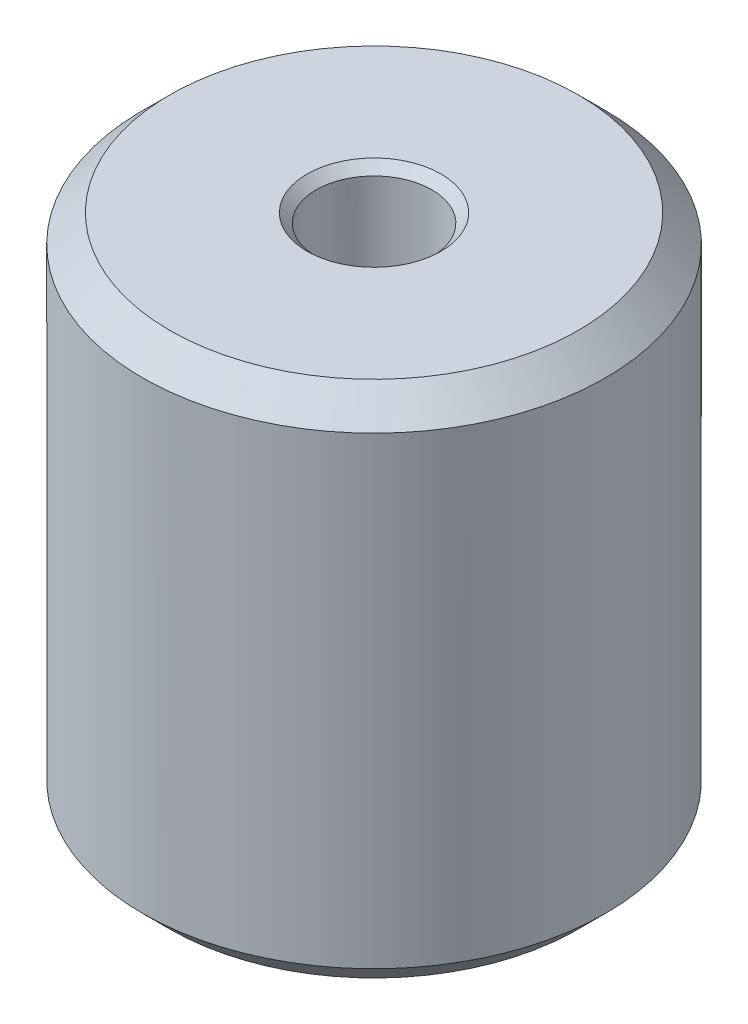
ISO-10303-21;
HEADER;
FILE_DESCRIPTION(('STEP AP214'),'2;1');
FILE_NAME('part.step','',(''),(''),'','','');
FILE_SCHEMA(('AUTOMOTIVE_DESIGN { 1 0 10303 214 1 1 1 1 }'));
ENDSEC;
DATA;
#1=APPLICATION_CONTEXT('core data for automotive mechanical design processes');
#2=APPLICATION_PROTOCOL_DEFINITION('international standard','automotive_design',2000,#1);
#3=PRODUCT_CONTEXT('',#1,'mechanical');
#4=PRODUCT('Part','Part','',(#3));
#5=PRODUCT_RELATED_PRODUCT_CATEGORY('part','',(#4));
#6=PRODUCT_DEFINITION_FORMATION('','',#4);
#7=PRODUCT_DEFINITION_CONTEXT('part definition',#1,'design');
#8=PRODUCT_DEFINITION('design','',#6,#7);
#9=PRODUCT_DEFINITION_SHAPE('','',#8);
#10=(LENGTH_UNIT() NAMED_UNIT(*) SI_UNIT(.MILLI.,.METRE.));
#11=(NAMED_UNIT(*) PLANE_ANGLE_UNIT() SI_UNIT($,.RADIAN.));
#12=(NAMED_UNIT(*) SI_UNIT($,.STERADIAN.) SOLID_ANGLE_UNIT());
#13=UNCERTAINTY_MEASURE_WITH_UNIT(LENGTH_MEASURE(1.E-05),#10,'distance_accuracy_value','');
#14=(GEOMETRIC_REPRESENTATION_CONTEXT(3) GLOBAL_UNCERTAINTY_ASSIGNED_CONTEXT((#13)) GLOBAL_UNIT_ASSIGNED_CONTEXT((#10,
#11,#12)) REPRESENTATION_CONTEXT('',''));
#15=CARTESIAN_POINT('',(0.,0.,0.));
#16=DIRECTION('',(0.,0.,1.));
#17=DIRECTION('',(1.,0.,0.));
#18=AXIS2_PLACEMENT_3D('',#15,#16,#17);
#19=CARTESIAN_POINT('',(-3.81,3.56,0.));
#20=DIRECTION('',(-1.,0.,0.));
#21=DIRECTION('',(0.,0.,1.));
#22=AXIS2_PLACEMENT_3D('',#19,#20,#21);
#23=CYLINDRICAL_SURFACE('',#22,1.7272);
#24=CARTESIAN_POINT('',(-3.81,3.56,0.));
#25=DIRECTION('',(1.,0.,0.));
#26=DIRECTION('',(0.,0.,-1.));
#27=AXIS2_PLACEMENT_3D('',#24,#25,#26);
#28=CIRCLE('',#27,1.7272);
#29=CARTESIAN_POINT('',(-3.81,3.56,-1.7272));
#30=VERTEX_POINT('',#29);
#31=EDGE_CURVE('E12',#30,#30,#28,.T.);
#32=ORIENTED_EDGE('',*,*,#31,.F.);
#33=EDGE_LOOP('',(#32));
#34=FACE_BOUND('',#33,.T.);
#35=CARTESIAN_POINT('',(-6.35,3.56,0.));
#36=DIRECTION('',(1.,0.,0.));
#37=DIRECTION('',(0.,0.,-1.));
#38=AXIS2_PLACEMENT_3D('',#35,#36,#37);
#39=CIRCLE('',#38,1.7272);
#40=CARTESIAN_POINT('',(-6.35,3.56,-1.7272));
#41=VERTEX_POINT('',#40);
#42=EDGE_CURVE('E49',#41,#41,#39,.T.);
#43=ORIENTED_EDGE('',*,*,#42,.T.);
#44=EDGE_LOOP('',(#43));
#45=FACE_BOUND('',#44,.T.);
#46=ADVANCED_FACE('F46',(#34,#45),#23,.T.);
#47=CARTESIAN_POINT('',(-3.81,3.56,0.));
#48=DIRECTION('',(1.,0.,0.));
#49=DIRECTION('',(0.,0.,-1.));
#50=AXIS2_PLACEMENT_3D('',#47,#48,#49);
#51=PLANE('',#50);
#52=ORIENTED_EDGE('',*,*,#31,.T.);
#53=EDGE_LOOP('',(#52));
#54=FACE_BOUND('',#53,.T.);
#55=ADVANCED_FACE('F171',(#54),#51,.T.);
#56=CARTESIAN_POINT('',(-6.35,3.56,0.));
#57=DIRECTION('',(1.,0.,0.));
#58=DIRECTION('',(0.,0.,-1.));
#59=AXIS2_PLACEMENT_3D('',#56,#57,#58);
#60=PLANE('',#59);
#61=DIRECTION('',(0.,0.,-1.));
#62=VECTOR('',#61,1.);
#63=CARTESIAN_POINT('',(-6.35,4.2474076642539,0.396874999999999));
#64=LINE('',#63,#62);
#65=CARTESIAN_POINT('',(-6.35,4.2474076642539,0.396874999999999));
#66=VERTEX_POINT('',#65);
#67=CARTESIAN_POINT('',(-6.35,4.2474076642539,-0.396875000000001));
#68=VERTEX_POINT('',#67);
#69=EDGE_CURVE('E134',#66,#68,#64,.T.);
#70=ORIENTED_EDGE('',*,*,#69,.F.);
#71=DIRECTION('',(0.,0.866025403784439,-0.5));
#72=VECTOR('',#71,1.);
#73=CARTESIAN_POINT('',(-6.35,3.56,0.793749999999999));
#74=LINE('',#73,#72);
#75=CARTESIAN_POINT('',(-6.35,3.56,0.793749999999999));
#76=VERTEX_POINT('',#75);
#77=EDGE_CURVE('E60',#76,#66,#74,.T.);
#78=ORIENTED_EDGE('',*,*,#77,.F.);
#79=DIRECTION('',(0.,0.866025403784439,0.5));
#80=VECTOR('',#79,1.);
#81=CARTESIAN_POINT('',(-6.35,2.8725923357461,0.396874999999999));
#82=LINE('',#81,#80);
#83=CARTESIAN_POINT('',(-6.35,2.8725923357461,0.396874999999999));
#84=VERTEX_POINT('',#83);
#85=EDGE_CURVE('E143',#84,#76,#82,.T.);
#86=ORIENTED_EDGE('',*,*,#85,.F.);
#87=DIRECTION('',(0.,0.,1.));
#88=VECTOR('',#87,1.);
#89=CARTESIAN_POINT('',(-6.35,2.8725923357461,-0.396875));
#90=LINE('',#89,#88);
#91=CARTESIAN_POINT('',(-6.35,2.8725923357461,-0.396875));
#92=VERTEX_POINT('',#91);
#93=EDGE_CURVE('E141',#92,#84,#90,.T.);
#94=ORIENTED_EDGE('',*,*,#93,.F.);
#95=DIRECTION('',(0.,-0.866025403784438,0.5));
#96=VECTOR('',#95,1.);
#97=CARTESIAN_POINT('',(-6.35,3.56,-0.79375));
#98=LINE('',#97,#96);
#99=CARTESIAN_POINT('',(-6.35,3.56,-0.79375));
#100=VERTEX_POINT('',#99);
#101=EDGE_CURVE('E108',#100,#92,#98,.T.);
#102=ORIENTED_EDGE('',*,*,#101,.F.);
#103=DIRECTION('',(0.,-0.866025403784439,-0.5));
#104=VECTOR('',#103,1.);
#105=CARTESIAN_POINT('',(-6.35,4.2474076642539,-0.396875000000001));
#106=LINE('',#105,#104);
#107=EDGE_CURVE('E137',#68,#100,#106,.T.);
#108=ORIENTED_EDGE('',*,*,#107,.F.);
#109=EDGE_LOOP('',(#70,#78,#86,#94,#102,#108));
#110=FACE_BOUND('',#109,.T.);
#111=ORIENTED_EDGE('',*,*,#42,.F.);
#112=EDGE_LOOP('',(#111));
#113=FACE_BOUND('',#112,.T.);
#114=ADVANCED_FACE('F156',(#110,#113),#60,.F.);
#115=CARTESIAN_POINT('',(-5.35,3.56,0.793749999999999));
#116=DIRECTION('',(0.,0.5,0.866025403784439));
#117=DIRECTION('',(0.,-0.866025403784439,0.5));
#118=AXIS2_PLACEMENT_3D('',#115,#116,#117);
#119=PLANE('',#118);
#120=ORIENTED_EDGE('',*,*,#77,.T.);
#121=DIRECTION('',(-1.,0.,0.));
#122=VECTOR('',#121,1.);
#123=CARTESIAN_POINT('',(-5.35,4.2474076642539,0.396874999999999));
#124=LINE('',#123,#122);
#125=CARTESIAN_POINT('',(-5.35,4.2474076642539,0.396874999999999));
#126=VERTEX_POINT('',#125);
#127=EDGE_CURVE('E90',#126,#66,#124,.T.);
#128=ORIENTED_EDGE('',*,*,#127,.F.);
#129=DIRECTION('',(0.,0.866025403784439,-0.5));
#130=VECTOR('',#129,1.);
#131=CARTESIAN_POINT('',(-5.35,3.56,0.793749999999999));
#132=LINE('',#131,#130);
#133=CARTESIAN_POINT('',(-5.35,3.56,0.793749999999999));
#134=VERTEX_POINT('',#133);
#135=EDGE_CURVE('E145',#134,#126,#132,.T.);
#136=ORIENTED_EDGE('',*,*,#135,.F.);
#137=DIRECTION('',(-1.,0.,0.));
#138=VECTOR('',#137,1.);
#139=CARTESIAN_POINT('',(-5.35,3.56,0.793749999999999));
#140=LINE('',#139,#138);
#141=EDGE_CURVE('E68',#134,#76,#140,.T.);
#142=ORIENTED_EDGE('',*,*,#141,.T.);
#143=EDGE_LOOP('',(#120,#128,#136,#142));
#144=FACE_BOUND('',#143,.T.);
#145=ADVANCED_FACE('F162',(#144),#119,.F.);
#146=CARTESIAN_POINT('',(-5.35,2.8725923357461,0.396874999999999));
#147=DIRECTION('',(0.,-0.5,0.866025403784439));
#148=DIRECTION('',(0.,-0.866025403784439,-0.5));
#149=AXIS2_PLACEMENT_3D('',#146,#147,#148);
#150=PLANE('',#149);
#151=ORIENTED_EDGE('',*,*,#85,.T.);
#152=ORIENTED_EDGE('',*,*,#141,.F.);
#153=DIRECTION('',(0.,0.866025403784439,0.5));
#154=VECTOR('',#153,1.);
#155=CARTESIAN_POINT('',(-5.35,2.8725923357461,0.396874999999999));
#156=LINE('',#155,#154);
#157=CARTESIAN_POINT('',(-5.35,2.8725923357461,0.396874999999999));
#158=VERTEX_POINT('',#157);
#159=EDGE_CURVE('E120',#158,#134,#156,.T.);
#160=ORIENTED_EDGE('',*,*,#159,.F.);
#161=DIRECTION('',(-1.,0.,0.));
#162=VECTOR('',#161,1.);
#163=CARTESIAN_POINT('',(-5.35,2.8725923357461,0.396874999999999));
#164=LINE('',#163,#162);
#165=EDGE_CURVE('E112',#158,#84,#164,.T.);
#166=ORIENTED_EDGE('',*,*,#165,.T.);
#167=EDGE_LOOP('',(#151,#152,#160,#166));
#168=FACE_BOUND('',#167,.T.);
#169=ADVANCED_FACE('F164',(#168),#150,.F.);
#170=CARTESIAN_POINT('',(-5.35,2.8725923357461,-0.396875));
#171=DIRECTION('',(0.,-1.,0.));
#172=DIRECTION('',(0.,0.,-1.));
#173=AXIS2_PLACEMENT_3D('',#170,#171,#172);
#174=PLANE('',#173);
#175=ORIENTED_EDGE('',*,*,#93,.T.);
#176=ORIENTED_EDGE('',*,*,#165,.F.);
#177=DIRECTION('',(0.,0.,1.));
#178=VECTOR('',#177,1.);
#179=CARTESIAN_POINT('',(-5.35,2.8725923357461,-0.396875));
#180=LINE('',#179,#178);
#181=CARTESIAN_POINT('',(-5.35,2.8725923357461,-0.396875));
#182=VERTEX_POINT('',#181);
#183=EDGE_CURVE('E116',#182,#158,#180,.T.);
#184=ORIENTED_EDGE('',*,*,#183,.F.);
#185=DIRECTION('',(-1.,0.,0.));
#186=VECTOR('',#185,1.);
#187=CARTESIAN_POINT('',(-5.35,2.8725923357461,-0.396875));
#188=LINE('',#187,#186);
#189=EDGE_CURVE('E101',#182,#92,#188,.T.);
#190=ORIENTED_EDGE('',*,*,#189,.T.);
#191=EDGE_LOOP('',(#175,#176,#184,#190));
#192=FACE_BOUND('',#191,.T.);
#193=ADVANCED_FACE('F117',(#192),#174,.F.);
#194=CARTESIAN_POINT('',(-5.35,3.56,-0.79375));
#195=DIRECTION('',(0.,-0.5,-0.866025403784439));
#196=DIRECTION('',(0.,0.866025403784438,-0.5));
#197=AXIS2_PLACEMENT_3D('',#194,#195,#196);
#198=PLANE('',#197);
#199=ORIENTED_EDGE('',*,*,#101,.T.);
#200=ORIENTED_EDGE('',*,*,#189,.F.);
#201=DIRECTION('',(0.,-0.866025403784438,0.5));
#202=VECTOR('',#201,1.);
#203=CARTESIAN_POINT('',(-5.35,3.56,-0.79375));
#204=LINE('',#203,#202);
#205=CARTESIAN_POINT('',(-5.35,3.56,-0.79375));
#206=VERTEX_POINT('',#205);
#207=EDGE_CURVE('E105',#206,#182,#204,.T.);
#208=ORIENTED_EDGE('',*,*,#207,.F.);
#209=DIRECTION('',(-1.,0.,0.));
#210=VECTOR('',#209,1.);
#211=CARTESIAN_POINT('',(-5.35,3.56,-0.79375));
#212=LINE('',#211,#210);
#213=EDGE_CURVE('E113',#206,#100,#212,.T.);
#214=ORIENTED_EDGE('',*,*,#213,.T.);
#215=EDGE_LOOP('',(#199,#200,#208,#214));
#216=FACE_BOUND('',#215,.T.);
#217=ADVANCED_FACE('F103',(#216),#198,.F.);
#218=CARTESIAN_POINT('',(-5.35,4.2474076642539,-0.396875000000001));
#219=DIRECTION('',(0.,0.499999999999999,-0.866025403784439));
#220=DIRECTION('',(0.,0.866025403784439,0.499999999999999));
#221=AXIS2_PLACEMENT_3D('',#218,#219,#220);
#222=PLANE('',#221);
#223=ORIENTED_EDGE('',*,*,#107,.T.);
#224=ORIENTED_EDGE('',*,*,#213,.F.);
#225=DIRECTION('',(0.,-0.866025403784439,-0.5));
#226=VECTOR('',#225,1.);
#227=CARTESIAN_POINT('',(-5.35,4.2474076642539,-0.396875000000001));
#228=LINE('',#227,#226);
#229=CARTESIAN_POINT('',(-5.35,4.2474076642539,-0.396875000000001));
#230=VERTEX_POINT('',#229);
#231=EDGE_CURVE('E126',#230,#206,#228,.T.);
#232=ORIENTED_EDGE('',*,*,#231,.F.);
#233=DIRECTION('',(-1.,0.,0.));
#234=VECTOR('',#233,1.);
#235=CARTESIAN_POINT('',(-5.35,4.2474076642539,-0.396875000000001));
#236=LINE('',#235,#234);
#237=EDGE_CURVE('E149',#230,#68,#236,.T.);
#238=ORIENTED_EDGE('',*,*,#237,.T.);
#239=EDGE_LOOP('',(#223,#224,#232,#238));
#240=FACE_BOUND('',#239,.T.);
#241=ADVANCED_FACE('F160',(#240),#222,.F.);
#242=CARTESIAN_POINT('',(-5.35,4.2474076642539,0.396874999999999));
#243=DIRECTION('',(0.,1.,0.));
#244=DIRECTION('',(0.,0.,1.));
#245=AXIS2_PLACEMENT_3D('',#242,#243,#244);
#246=PLANE('',#245);
#247=ORIENTED_EDGE('',*,*,#69,.T.);
#248=ORIENTED_EDGE('',*,*,#237,.F.);
#249=DIRECTION('',(0.,0.,-1.));
#250=VECTOR('',#249,1.);
#251=CARTESIAN_POINT('',(-5.35,4.2474076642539,0.396874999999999));
#252=LINE('',#251,#250);
#253=EDGE_CURVE('E128',#126,#230,#252,.T.);
#254=ORIENTED_EDGE('',*,*,#253,.F.);
#255=ORIENTED_EDGE('',*,*,#127,.T.);
#256=EDGE_LOOP('',(#247,#248,#254,#255));
#257=FACE_BOUND('',#256,.T.);
#258=ADVANCED_FACE('F153',(#257),#246,.F.);
#259=CARTESIAN_POINT('',(-5.35,4.2474076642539,0.396874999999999));
#260=DIRECTION('',(-1.,0.,0.));
#261=DIRECTION('',(0.,0.,1.));
#262=AXIS2_PLACEMENT_3D('',#259,#260,#261);
#263=PLANE('',#262);
#264=ORIENTED_EDGE('',*,*,#135,.T.);
#265=ORIENTED_EDGE('',*,*,#253,.T.);
#266=ORIENTED_EDGE('',*,*,#231,.T.);
#267=ORIENTED_EDGE('',*,*,#207,.T.);
#268=ORIENTED_EDGE('',*,*,#183,.T.);
#269=ORIENTED_EDGE('',*,*,#159,.T.);
#270=EDGE_LOOP('',(#264,#265,#266,#267,#268,#269));
#271=FACE_BOUND('',#270,.T.);
#272=ADVANCED_FACE('F123',(#271),#263,.T.);
#273=CLOSED_SHELL('',(#46,#55,#114,#145,#169,#193,#217,#241,#258,#272));
#274=MANIFOLD_SOLID_BREP('B2',#273);
#275=CARTESIAN_POINT('',(-3.81,10.668,0.));
#276=DIRECTION('',(-1.,0.,0.));
#277=DIRECTION('',(0.,0.,1.));
#278=AXIS2_PLACEMENT_3D('',#275,#276,#277);
#279=CYLINDRICAL_SURFACE('',#278,1.0922);
#280=CARTESIAN_POINT('',(-3.81,10.668,0.));
#281=DIRECTION('',(1.,0.,0.));
#282=DIRECTION('',(0.,0.,-1.));
#283=AXIS2_PLACEMENT_3D('',#280,#281,#282);
#284=CIRCLE('',#283,1.0922);
#285=CARTESIAN_POINT('',(-3.81,10.668,-1.0922));
#286=VERTEX_POINT('',#285);
#287=EDGE_CURVE('E44',#286,#286,#284,.T.);
#288=ORIENTED_EDGE('',*,*,#287,.F.);
#289=EDGE_LOOP('',(#288));
#290=FACE_BOUND('',#289,.T.);
#291=CARTESIAN_POINT('',(-6.35,10.668,0.));
#292=DIRECTION('',(1.,0.,0.));
#293=DIRECTION('',(0.,0.,-1.));
#294=AXIS2_PLACEMENT_3D('',#291,#292,#293);
#295=CIRCLE('',#294,1.0922);
#296=CARTESIAN_POINT('',(-6.35,10.668,-1.0922));
#297=VERTEX_POINT('',#296);
#298=EDGE_CURVE('E262',#297,#297,#295,.T.);
#299=ORIENTED_EDGE('',*,*,#298,.T.);
#300=EDGE_LOOP('',(#299));
#301=FACE_BOUND('',#300,.T.);
#302=ADVANCED_FACE('F259',(#290,#301),#279,.T.);
#303=CARTESIAN_POINT('',(-3.81,10.668,0.));
#304=DIRECTION('',(1.,0.,0.));
#305=DIRECTION('',(0.,0.,-1.));
#306=AXIS2_PLACEMENT_3D('',#303,#304,#305);
#307=PLANE('',#306);
#308=ORIENTED_EDGE('',*,*,#287,.T.);
#309=EDGE_LOOP('',(#308));
#310=FACE_BOUND('',#309,.T.);
#311=ADVANCED_FACE('F384',(#310),#307,.T.);
#312=CARTESIAN_POINT('',(-6.35,10.668,0.));
#313=DIRECTION('',(1.,0.,0.));
#314=DIRECTION('',(0.,0.,-1.));
#315=AXIS2_PLACEMENT_3D('',#312,#313,#314);
#316=PLANE('',#315);
#317=DIRECTION('',(0.,0.,-1.));
#318=VECTOR('',#317,1.);
#319=CARTESIAN_POINT('',(-6.35,11.0529482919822,0.222249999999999));
#320=LINE('',#319,#318);
#321=CARTESIAN_POINT('',(-6.35,11.0529482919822,0.222249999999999));
#322=VERTEX_POINT('',#321);
#323=CARTESIAN_POINT('',(-6.35,11.0529482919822,-0.222250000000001));
#324=VERTEX_POINT('',#323);
#325=EDGE_CURVE('E347',#322,#324,#320,.T.);
#326=ORIENTED_EDGE('',*,*,#325,.F.);
#327=DIRECTION('',(0.,0.866025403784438,-0.500000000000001));
#328=VECTOR('',#327,1.);
#329=CARTESIAN_POINT('',(-6.35,10.668,0.444499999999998));
#330=LINE('',#329,#328);
#331=CARTESIAN_POINT('',(-6.35,10.668,0.444499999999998));
#332=VERTEX_POINT('',#331);
#333=EDGE_CURVE('E273',#332,#322,#330,.T.);
#334=ORIENTED_EDGE('',*,*,#333,.F.);
#335=DIRECTION('',(0.,0.86602540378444,0.499999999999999));
#336=VECTOR('',#335,1.);
#337=CARTESIAN_POINT('',(-6.35,10.2830517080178,0.222249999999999));
#338=LINE('',#337,#336);
#339=CARTESIAN_POINT('',(-6.35,10.2830517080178,0.222249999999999));
#340=VERTEX_POINT('',#339);
#341=EDGE_CURVE('E356',#340,#332,#338,.T.);
#342=ORIENTED_EDGE('',*,*,#341,.F.);
#343=DIRECTION('',(0.,0.,1.));
#344=VECTOR('',#343,1.);
#345=CARTESIAN_POINT('',(-6.35,10.2830517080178,-0.222250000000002));
#346=LINE('',#345,#344);
#347=CARTESIAN_POINT('',(-6.35,10.2830517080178,-0.222250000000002));
#348=VERTEX_POINT('',#347);
#349=EDGE_CURVE('E354',#348,#340,#346,.T.);
#350=ORIENTED_EDGE('',*,*,#349,.F.);
#351=DIRECTION('',(0.,-0.866025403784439,0.5));
#352=VECTOR('',#351,1.);
#353=CARTESIAN_POINT('',(-6.35,10.668,-0.444500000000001));
#354=LINE('',#353,#352);
#355=CARTESIAN_POINT('',(-6.35,10.668,-0.444500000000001));
#356=VERTEX_POINT('',#355);
#357=EDGE_CURVE('E321',#356,#348,#354,.T.);
#358=ORIENTED_EDGE('',*,*,#357,.F.);
#359=DIRECTION('',(0.,-0.866025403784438,-0.5));
#360=VECTOR('',#359,1.);
#361=CARTESIAN_POINT('',(-6.35,11.0529482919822,-0.222250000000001));
#362=LINE('',#361,#360);
#363=EDGE_CURVE('E350',#324,#356,#362,.T.);
#364=ORIENTED_EDGE('',*,*,#363,.F.);
#365=EDGE_LOOP('',(#326,#334,#342,#350,#358,#364));
#366=FACE_BOUND('',#365,.T.);
#367=ORIENTED_EDGE('',*,*,#298,.F.);
#368=EDGE_LOOP('',(#367));
#369=FACE_BOUND('',#368,.T.);
#370=ADVANCED_FACE('F369',(#366,#369),#316,.F.);
#371=CARTESIAN_POINT('',(-5.35,10.668,0.444499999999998));
#372=DIRECTION('',(0.,0.500000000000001,0.866025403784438));
#373=DIRECTION('',(0.,-0.866025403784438,0.500000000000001));
#374=AXIS2_PLACEMENT_3D('',#371,#372,#373);
#375=PLANE('',#374);
#376=ORIENTED_EDGE('',*,*,#333,.T.);
#377=DIRECTION('',(-1.,0.,0.));
#378=VECTOR('',#377,1.);
#379=CARTESIAN_POINT('',(-5.35,11.0529482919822,0.222249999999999));
#380=LINE('',#379,#378);
#381=CARTESIAN_POINT('',(-5.35,11.0529482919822,0.222249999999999));
#382=VERTEX_POINT('',#381);
#383=EDGE_CURVE('E303',#382,#322,#380,.T.);
#384=ORIENTED_EDGE('',*,*,#383,.F.);
#385=DIRECTION('',(0.,0.866025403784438,-0.500000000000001));
#386=VECTOR('',#385,1.);
#387=CARTESIAN_POINT('',(-5.35,10.668,0.444499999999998));
#388=LINE('',#387,#386);
#389=CARTESIAN_POINT('',(-5.35,10.668,0.444499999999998));
#390=VERTEX_POINT('',#389);
#391=EDGE_CURVE('E358',#390,#382,#388,.T.);
#392=ORIENTED_EDGE('',*,*,#391,.F.);
#393=DIRECTION('',(-1.,0.,0.));
#394=VECTOR('',#393,1.);
#395=CARTESIAN_POINT('',(-5.35,10.668,0.444499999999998));
#396=LINE('',#395,#394);
#397=EDGE_CURVE('E281',#390,#332,#396,.T.);
#398=ORIENTED_EDGE('',*,*,#397,.T.);
#399=EDGE_LOOP('',(#376,#384,#392,#398));
#400=FACE_BOUND('',#399,.T.);
#401=ADVANCED_FACE('F375',(#400),#375,.F.);
#402=CARTESIAN_POINT('',(-5.35,10.2830517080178,0.222249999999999));
#403=DIRECTION('',(0.,-0.499999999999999,0.866025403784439));
#404=DIRECTION('',(0.,-0.86602540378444,-0.499999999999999));
#405=AXIS2_PLACEMENT_3D('',#402,#403,#404);
#406=PLANE('',#405);
#407=ORIENTED_EDGE('',*,*,#341,.T.);
#408=ORIENTED_EDGE('',*,*,#397,.F.);
#409=DIRECTION('',(0.,0.86602540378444,0.499999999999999));
#410=VECTOR('',#409,1.);
#411=CARTESIAN_POINT('',(-5.35,10.2830517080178,0.222249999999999));
#412=LINE('',#411,#410);
#413=CARTESIAN_POINT('',(-5.35,10.2830517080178,0.222249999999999));
#414=VERTEX_POINT('',#413);
#415=EDGE_CURVE('E333',#414,#390,#412,.T.);
#416=ORIENTED_EDGE('',*,*,#415,.F.);
#417=DIRECTION('',(-1.,0.,0.));
#418=VECTOR('',#417,1.);
#419=CARTESIAN_POINT('',(-5.35,10.2830517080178,0.222249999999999));
#420=LINE('',#419,#418);
#421=EDGE_CURVE('E325',#414,#340,#420,.T.);
#422=ORIENTED_EDGE('',*,*,#421,.T.);
#423=EDGE_LOOP('',(#407,#408,#416,#422));
#424=FACE_BOUND('',#423,.T.);
#425=ADVANCED_FACE('F377',(#424),#406,.F.);
#426=CARTESIAN_POINT('',(-5.35,10.2830517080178,-0.222250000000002));
#427=DIRECTION('',(0.,-1.,0.));
#428=DIRECTION('',(0.,0.,-1.));
#429=AXIS2_PLACEMENT_3D('',#426,#427,#428);
#430=PLANE('',#429);
#431=ORIENTED_EDGE('',*,*,#349,.T.);
#432=ORIENTED_EDGE('',*,*,#421,.F.);
#433=DIRECTION('',(0.,0.,1.));
#434=VECTOR('',#433,1.);
#435=CARTESIAN_POINT('',(-5.35,10.2830517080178,-0.222250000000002));
#436=LINE('',#435,#434);
#437=CARTESIAN_POINT('',(-5.35,10.2830517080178,-0.222250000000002));
#438=VERTEX_POINT('',#437);
#439=EDGE_CURVE('E329',#438,#414,#436,.T.);
#440=ORIENTED_EDGE('',*,*,#439,.F.);
#441=DIRECTION('',(-1.,0.,0.));
#442=VECTOR('',#441,1.);
#443=CARTESIAN_POINT('',(-5.35,10.2830517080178,-0.222250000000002));
#444=LINE('',#443,#442);
#445=EDGE_CURVE('E314',#438,#348,#444,.T.);
#446=ORIENTED_EDGE('',*,*,#445,.T.);
#447=EDGE_LOOP('',(#431,#432,#440,#446));
#448=FACE_BOUND('',#447,.T.);
#449=ADVANCED_FACE('F330',(#448),#430,.F.);
#450=CARTESIAN_POINT('',(-5.35,10.668,-0.444500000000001));
#451=DIRECTION('',(0.,-0.5,-0.866025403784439));
#452=DIRECTION('',(0.,0.866025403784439,-0.5));
#453=AXIS2_PLACEMENT_3D('',#450,#451,#452);
#454=PLANE('',#453);
#455=ORIENTED_EDGE('',*,*,#357,.T.);
#456=ORIENTED_EDGE('',*,*,#445,.F.);
#457=DIRECTION('',(0.,-0.866025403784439,0.5));
#458=VECTOR('',#457,1.);
#459=CARTESIAN_POINT('',(-5.35,10.668,-0.444500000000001));
#460=LINE('',#459,#458);
#461=CARTESIAN_POINT('',(-5.35,10.668,-0.444500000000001));
#462=VERTEX_POINT('',#461);
#463=EDGE_CURVE('E318',#462,#438,#460,.T.);
#464=ORIENTED_EDGE('',*,*,#463,.F.);
#465=DIRECTION('',(-1.,0.,0.));
#466=VECTOR('',#465,1.);
#467=CARTESIAN_POINT('',(-5.35,10.668,-0.444500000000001));
#468=LINE('',#467,#466);
#469=EDGE_CURVE('E326',#462,#356,#468,.T.);
#470=ORIENTED_EDGE('',*,*,#469,.T.);
#471=EDGE_LOOP('',(#455,#456,#464,#470));
#472=FACE_BOUND('',#471,.T.);
#473=ADVANCED_FACE('F316',(#472),#454,.F.);
#474=CARTESIAN_POINT('',(-5.35,11.0529482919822,-0.222250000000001));
#475=DIRECTION('',(0.,0.5,-0.866025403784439));
#476=DIRECTION('',(0.,0.866025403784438,0.5));
#477=AXIS2_PLACEMENT_3D('',#474,#475,#476);
#478=PLANE('',#477);
#479=ORIENTED_EDGE('',*,*,#363,.T.);
#480=ORIENTED_EDGE('',*,*,#469,.F.);
#481=DIRECTION('',(0.,-0.866025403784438,-0.5));
#482=VECTOR('',#481,1.);
#483=CARTESIAN_POINT('',(-5.35,11.0529482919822,-0.222250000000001));
#484=LINE('',#483,#482);
#485=CARTESIAN_POINT('',(-5.35,11.0529482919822,-0.222250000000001));
#486=VERTEX_POINT('',#485);
#487=EDGE_CURVE('E339',#486,#462,#484,.T.);
#488=ORIENTED_EDGE('',*,*,#487,.F.);
#489=DIRECTION('',(-1.,0.,0.));
#490=VECTOR('',#489,1.);
#491=CARTESIAN_POINT('',(-5.35,11.0529482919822,-0.222250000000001));
#492=LINE('',#491,#490);
#493=EDGE_CURVE('E362',#486,#324,#492,.T.);
#494=ORIENTED_EDGE('',*,*,#493,.T.);
#495=EDGE_LOOP('',(#479,#480,#488,#494));
#496=FACE_BOUND('',#495,.T.);
#497=ADVANCED_FACE('F373',(#496),#478,.F.);
#498=CARTESIAN_POINT('',(-5.35,11.0529482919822,0.222249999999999));
#499=DIRECTION('',(0.,1.,0.));
#500=DIRECTION('',(0.,0.,1.));
#501=AXIS2_PLACEMENT_3D('',#498,#499,#500);
#502=PLANE('',#501);
#503=ORIENTED_EDGE('',*,*,#325,.T.);
#504=ORIENTED_EDGE('',*,*,#493,.F.);
#505=DIRECTION('',(0.,0.,-1.));
#506=VECTOR('',#505,1.);
#507=CARTESIAN_POINT('',(-5.35,11.0529482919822,0.222249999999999));
#508=LINE('',#507,#506);
#509=EDGE_CURVE('E341',#382,#486,#508,.T.);
#510=ORIENTED_EDGE('',*,*,#509,.F.);
#511=ORIENTED_EDGE('',*,*,#383,.T.);
#512=EDGE_LOOP('',(#503,#504,#510,#511));
#513=FACE_BOUND('',#512,.T.);
#514=ADVANCED_FACE('F366',(#513),#502,.F.);
#515=CARTESIAN_POINT('',(-5.35,11.0529482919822,0.222249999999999));
#516=DIRECTION('',(-1.,0.,0.));
#517=DIRECTION('',(0.,0.,1.));
#518=AXIS2_PLACEMENT_3D('',#515,#516,#517);
#519=PLANE('',#518);
#520=ORIENTED_EDGE('',*,*,#391,.T.);
#521=ORIENTED_EDGE('',*,*,#509,.T.);
#522=ORIENTED_EDGE('',*,*,#487,.T.);
#523=ORIENTED_EDGE('',*,*,#463,.T.);
#524=ORIENTED_EDGE('',*,*,#439,.T.);
#525=ORIENTED_EDGE('',*,*,#415,.T.);
#526=EDGE_LOOP('',(#520,#521,#522,#523,#524,#525));
#527=FACE_BOUND('',#526,.T.);
#528=ADVANCED_FACE('F336',(#527),#519,.T.);
#529=CLOSED_SHELL('',(#302,#311,#370,#401,#425,#449,#473,#497,#514,#528));
#530=MANIFOLD_SOLID_BREP('B6',#529);
#531=CARTESIAN_POINT('',(-6.35,0.,0.));
#532=DIRECTION('',(0.,1.,0.));
#533=DIRECTION('',(0.,0.,1.));
#534=AXIS2_PLACEMENT_3D('',#531,#532,#533);
#535=PLANE('',#534);
#536=CARTESIAN_POINT('',(0.,0.,0.));
#537=DIRECTION('',(0.,1.,0.));
#538=DIRECTION('',(0.,0.,1.));
#539=AXIS2_PLACEMENT_3D('',#536,#537,#538);
#540=CIRCLE('',#539,3.425);
#541=CARTESIAN_POINT('',(0.,0.,3.425));
#542=VERTEX_POINT('',#541);
#543=EDGE_CURVE('E547',#542,#542,#540,.T.);
#544=ORIENTED_EDGE('',*,*,#543,.T.);
#545=EDGE_LOOP('',(#544));
#546=FACE_BOUND('',#545,.T.);
#547=CARTESIAN_POINT('',(0.,0.,0.));
#548=DIRECTION('',(0.,1.,0.));
#549=DIRECTION('',(0.,0.,1.));
#550=AXIS2_PLACEMENT_3D('',#547,#548,#549);
#551=CIRCLE('',#550,5.6);
#552=CARTESIAN_POINT('',(0.,0.,5.6));
#553=VERTEX_POINT('',#552);
#554=EDGE_CURVE('E571',#553,#553,#551,.F.);
#555=ORIENTED_EDGE('',*,*,#554,.T.);
#556=EDGE_LOOP('',(#555));
#557=FACE_BOUND('',#556,.T.);
#558=ADVANCED_FACE('F464',(#546,#557),#535,.F.);
#559=CARTESIAN_POINT('',(0.,0.,0.));
#560=DIRECTION('',(0.,-1.,0.));
#561=DIRECTION('',(0.,0.,-1.));
#562=AXIS2_PLACEMENT_3D('',#559,#560,#561);
#563=CYLINDRICAL_SURFACE('',#562,3.175);
#564=CARTESIAN_POINT('',(-2.6640955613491,3.56,-1.7272));
#565=CARTESIAN_POINT('',(-2.66410486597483,3.47129456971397,-1.72719323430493));
#566=CARTESIAN_POINT('',(-2.66859575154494,3.3825070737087,-1.72031913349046));
#567=CARTESIAN_POINT('',(-2.68586358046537,3.20776255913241,-1.69322231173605));
#568=CARTESIAN_POINT('',(-2.69865488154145,3.12181071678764,-1.67297645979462));
#569=CARTESIAN_POINT('',(-2.73057971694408,2.95561182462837,-1.62033673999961));
#570=CARTESIAN_POINT('',(-2.74967438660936,2.87533338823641,-1.58801715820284));
#571=CARTESIAN_POINT('',(-2.79199169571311,2.72136679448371,-1.51237588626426));
#572=CARTESIAN_POINT('',(-2.81521512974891,2.64767990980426,-1.4690520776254));
#573=CARTESIAN_POINT('',(-2.86596050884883,2.50098075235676,-1.36763098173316));
#574=CARTESIAN_POINT('',(-2.89368047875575,2.42875304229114,-1.30849754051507));
#575=CARTESIAN_POINT('',(-2.94870559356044,2.29461298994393,-1.17927756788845));
#576=CARTESIAN_POINT('',(-2.97601048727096,2.23270668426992,-1.10918467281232));
#577=CARTESIAN_POINT('',(-3.02984617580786,2.11588370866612,-0.952908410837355));
#578=CARTESIAN_POINT('',(-3.056122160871,2.06198163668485,-0.865870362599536));
#579=CARTESIAN_POINT('',(-3.1022694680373,1.96994990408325,-0.682261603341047));
#580=CARTESIAN_POINT('',(-3.1221455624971,1.93180848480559,-0.585698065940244));
#581=CARTESIAN_POINT('',(-3.15180853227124,1.87565716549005,-0.394132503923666));
#582=CARTESIAN_POINT('',(-3.16228715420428,1.85625684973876,-0.299647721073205));
#583=CARTESIAN_POINT('',(-3.17459950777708,1.83350818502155,-0.108233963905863));
#584=CARTESIAN_POINT('',(-3.17643962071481,1.83014798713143,-0.0113068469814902));
#585=CARTESIAN_POINT('',(-3.17154501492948,1.83915784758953,0.171568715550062));
#586=CARTESIAN_POINT('',(-3.16566987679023,1.84995087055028,0.257624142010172));
#587=CARTESIAN_POINT('',(-3.14737247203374,1.88406580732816,0.426478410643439));
#588=CARTESIAN_POINT('',(-3.13494970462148,1.90738867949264,0.509277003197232));
#589=CARTESIAN_POINT('',(-3.10449034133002,1.96592201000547,0.670506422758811));
#590=CARTESIAN_POINT('',(-3.08639225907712,2.00126304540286,0.748877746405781));
#591=CARTESIAN_POINT('',(-3.0461332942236,2.08258000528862,0.898735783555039));
#592=CARTESIAN_POINT('',(-3.02397108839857,2.12855939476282,0.970220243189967));
#593=CARTESIAN_POINT('',(-2.97479860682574,2.23542160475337,1.11240296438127));
#594=CARTESIAN_POINT('',(-2.94752340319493,2.29736926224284,1.18220941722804));
#595=CARTESIAN_POINT('',(-2.89256053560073,2.43161426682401,1.31096518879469));
#596=CARTESIAN_POINT('',(-2.86487248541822,2.50392193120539,1.36990354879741));
#597=CARTESIAN_POINT('',(-2.80957193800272,2.66422361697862,1.48022020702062));
#598=CARTESIAN_POINT('',(-2.78216433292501,2.75302742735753,1.53053586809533));
#599=CARTESIAN_POINT('',(-2.73390662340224,2.93959096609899,1.61516932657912));
#600=CARTESIAN_POINT('',(-2.71304898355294,3.03734023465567,1.64950552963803));
#601=CARTESIAN_POINT('',(-2.68279571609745,3.23084500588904,1.69823451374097));
#602=CARTESIAN_POINT('',(-2.67260829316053,3.32612029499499,1.71401782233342));
#603=CARTESIAN_POINT('',(-2.66269602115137,3.51846806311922,1.72938570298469));
#604=CARTESIAN_POINT('',(-2.66295990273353,3.61553849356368,1.72898772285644));
#605=CARTESIAN_POINT('',(-2.67307950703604,3.79405186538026,1.7132779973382));
#606=CARTESIAN_POINT('',(-2.68158063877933,3.87577218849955,1.70007217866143));
#607=CARTESIAN_POINT('',(-2.70506204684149,4.03561822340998,1.66245374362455));
#608=CARTESIAN_POINT('',(-2.72004504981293,4.11374240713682,1.63803641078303));
#609=CARTESIAN_POINT('',(-2.75551969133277,4.26808161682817,1.57765825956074));
#610=CARTESIAN_POINT('',(-2.77622056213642,4.34406996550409,1.54124607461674));
#611=CARTESIAN_POINT('',(-2.82068054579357,4.48931305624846,1.45828688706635));
#612=CARTESIAN_POINT('',(-2.8444411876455,4.5585644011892,1.41173480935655));
#613=CARTESIAN_POINT('',(-2.89673912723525,4.69957032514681,1.3014594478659));
#614=CARTESIAN_POINT('',(-2.92544767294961,4.77006175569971,1.23619488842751));
#615=CARTESIAN_POINT('',(-2.98135484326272,4.89958436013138,1.09450973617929));
#616=CARTESIAN_POINT('',(-3.00855262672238,4.95860919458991,1.01808301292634));
#617=CARTESIAN_POINT('',(-3.05996298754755,5.06608803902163,0.851578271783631));
#618=CARTESIAN_POINT('',(-3.08397399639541,5.1139113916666,0.761026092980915));
#619=CARTESIAN_POINT('',(-3.12464179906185,5.19313888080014,0.571486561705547));
#620=CARTESIAN_POINT('',(-3.14130610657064,5.22455979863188,0.472507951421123));
#621=CARTESIAN_POINT('',(-3.16399536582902,5.2669696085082,0.279674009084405));
#622=CARTESIAN_POINT('',(-3.17092358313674,5.27969906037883,0.186308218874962));
#623=CARTESIAN_POINT('',(-3.17638590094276,5.28975264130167,-0.00147767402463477));
#624=CARTESIAN_POINT('',(-3.17492421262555,5.28708449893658,-0.0958972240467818));
#625=CARTESIAN_POINT('',(-3.16427179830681,5.26741507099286,-0.274447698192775));
#626=CARTESIAN_POINT('',(-3.15575934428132,5.25167129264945,-0.35876304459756));
#627=CARTESIAN_POINT('',(-3.13267146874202,5.20820017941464,-0.523358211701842));
#628=CARTESIAN_POINT('',(-3.11809530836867,5.18047138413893,-0.603637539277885));
#629=CARTESIAN_POINT('',(-3.08350544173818,5.11289153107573,-0.761154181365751));
#630=CARTESIAN_POINT('',(-3.06331693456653,5.07264476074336,-0.838182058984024));
#631=CARTESIAN_POINT('',(-3.01942645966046,4.98166036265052,-0.984654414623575));
#632=CARTESIAN_POINT('',(-2.99572303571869,4.93091838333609,-1.05409572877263));
#633=CARTESIAN_POINT('',(-2.94385835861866,4.81377953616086,-1.19177481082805));
#634=CARTESIAN_POINT('',(-2.9154963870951,4.74625999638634,-1.25898340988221));
#635=CARTESIAN_POINT('',(-2.85942726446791,4.60087325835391,-1.38161440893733));
#636=CARTESIAN_POINT('',(-2.83172091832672,4.52299404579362,-1.43702292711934));
#637=CARTESIAN_POINT('',(-2.77840107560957,4.35310154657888,-1.53771116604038));
#638=CARTESIAN_POINT('',(-2.75302287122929,4.26051210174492,-1.5821528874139));
#639=CARTESIAN_POINT('',(-2.71036948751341,4.06739356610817,-1.65417893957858));
#640=CARTESIAN_POINT('',(-2.69306824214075,3.96689125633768,-1.681817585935));
#641=CARTESIAN_POINT('',(-2.67573191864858,3.8142258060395,-1.70914665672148));
#642=CARTESIAN_POINT('',(-2.67139256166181,3.76372648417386,-1.71590078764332));
#643=CARTESIAN_POINT('',(-2.66557169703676,3.66216051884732,-1.72492941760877));
#644=CARTESIAN_POINT('',(-2.66409020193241,3.61109387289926,-1.72720389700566));
#645=CARTESIAN_POINT('',(-2.6640955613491,3.56,-1.7272));
#646=B_SPLINE_CURVE_WITH_KNOTS('',3,(#564,#565,#566,#567,#568,#569,#570,#571,#572,#573,#574,
#575,#576,#577,#578,#579,#580,#581,#582,#583,#584,#585,#586,#587,#588,#589,#590,#591,#592,#593,
#594,#595,#596,#597,#598,#599,#600,#601,#602,#603,#604,#605,#606,#607,#608,#609,#610,#611,#612,
#613,#614,#615,#616,#617,#618,#619,#620,#621,#622,#623,#624,#625,#626,#627,#628,#629,#630,#631,
#632,#633,#634,#635,#636,#637,#638,#639,#640,#641,#642,#643,#644,#645),.UNSPECIFIED.,.T.,.F.,(4,
2,2,2,2,2,2,2,2,2,2,2,2,2,2,2,2,2,2,2,2,2,2,2,2,2,2,2,2,2,2,2,2,2,2,2,2,2,2,2,4),(0.,
0.265899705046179,0.532260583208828,0.797008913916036,1.06180825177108,1.35274578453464,
1.64385288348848,1.95925628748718,2.27442394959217,2.56383650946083,2.85303524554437,
3.11259135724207,3.37216732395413,3.63465880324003,3.89723589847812,4.18773288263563,
4.47852120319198,4.79393052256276,5.1089756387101,5.39849355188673,5.68769929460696,
5.93621992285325,6.18484519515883,6.44416515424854,6.7036152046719,7.00310702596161,
7.30276395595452,7.61656871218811,7.93005178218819,8.21192979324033,8.49366633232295,
8.75107595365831,9.00851694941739,9.27510514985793,9.54180410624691,9.8387420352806,
10.1360273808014,10.4516923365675,10.7663314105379,10.919487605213,11.072644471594),.UNSPECIFIED.);
#647=CARTESIAN_POINT('',(-2.6640955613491,3.56,-1.7272));
#648=VERTEX_POINT('',#647);
#649=EDGE_CURVE('E508',#648,#648,#646,.T.);
#650=ORIENTED_EDGE('',*,*,#649,.T.);
#651=EDGE_LOOP('',(#650));
#652=FACE_BOUND('',#651,.T.);
#653=CARTESIAN_POINT('',(0.,0.249999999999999,0.));
#654=DIRECTION('',(0.,1.,0.));
#655=DIRECTION('',(0.,0.,1.));
#656=AXIS2_PLACEMENT_3D('',#653,#654,#655);
#657=CIRCLE('',#656,3.175);
#658=CARTESIAN_POINT('',(0.,0.249999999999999,3.175));
#659=VERTEX_POINT('',#658);
#660=EDGE_CURVE('E550',#659,#659,#657,.F.);
#661=ORIENTED_EDGE('',*,*,#660,.T.);
#662=EDGE_LOOP('',(#661));
#663=FACE_BOUND('',#662,.T.);
#664=CARTESIAN_POINT('',(0.,6.985,0.));
#665=DIRECTION('',(0.,-1.,0.));
#666=DIRECTION('',(0.,0.,-1.));
#667=AXIS2_PLACEMENT_3D('',#664,#665,#666);
#668=CIRCLE('',#667,3.175);
#669=CARTESIAN_POINT('',(0.,6.985,-3.175));
#670=VERTEX_POINT('',#669);
#671=EDGE_CURVE('E575',#670,#670,#668,.T.);
#672=ORIENTED_EDGE('',*,*,#671,.F.);
#673=EDGE_LOOP('',(#672));
#674=FACE_BOUND('',#673,.T.);
#675=ADVANCED_FACE('F521',(#652,#663,#674),#563,.F.);
#676=CARTESIAN_POINT('',(-3.175,6.985,0.));
#677=DIRECTION('',(0.,1.,0.));
#678=DIRECTION('',(0.,0.,1.));
#679=AXIS2_PLACEMENT_3D('',#676,#677,#678);
#680=PLANE('',#679);
#681=CARTESIAN_POINT('',(0.,6.985,0.));
#682=DIRECTION('',(0.,-1.,0.));
#683=DIRECTION('',(0.,0.,-1.));
#684=AXIS2_PLACEMENT_3D('',#681,#682,#683);
#685=CIRCLE('',#684,1.5875);
#686=CARTESIAN_POINT('',(0.,6.985,-1.5875));
#687=VERTEX_POINT('',#686);
#688=EDGE_CURVE('E507',#687,#687,#685,.T.);
#689=ORIENTED_EDGE('',*,*,#688,.F.);
#690=EDGE_LOOP('',(#689));
#691=FACE_BOUND('',#690,.T.);
#692=ORIENTED_EDGE('',*,*,#671,.T.);
#693=EDGE_LOOP('',(#692));
#694=FACE_BOUND('',#693,.T.);
#695=ADVANCED_FACE('F518',(#691,#694),#680,.F.);
#696=CARTESIAN_POINT('',(0.,0.,0.));
#697=DIRECTION('',(0.,-1.,0.));
#698=DIRECTION('',(0.,0.,-1.));
#699=AXIS2_PLACEMENT_3D('',#696,#697,#698);
#700=CYLINDRICAL_SURFACE('',#699,1.5875);
#701=CARTESIAN_POINT('',(-1.15206571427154,10.668,-1.0922));
#702=CARTESIAN_POINT('',(-1.15207272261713,10.6152561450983,-1.09219623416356));
#703=CARTESIAN_POINT('',(-1.15575946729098,10.5624868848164,-1.08834339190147));
#704=CARTESIAN_POINT('',(-1.16975453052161,10.4588802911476,-1.07327859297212));
#705=CARTESIAN_POINT('',(-1.18007702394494,10.4080473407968,-1.0620508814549));
#706=CARTESIAN_POINT('',(-1.20543593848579,10.3101739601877,-1.03317059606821));
#707=CARTESIAN_POINT('',(-1.22042173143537,10.263099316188,-1.01558671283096));
#708=CARTESIAN_POINT('',(-1.25332988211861,10.1726643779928,-0.974684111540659));
#709=CARTESIAN_POINT('',(-1.27125260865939,10.1293045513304,-0.951364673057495));
#710=CARTESIAN_POINT('',(-1.31161191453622,10.0395593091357,-0.895108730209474));
#711=CARTESIAN_POINT('',(-1.33430121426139,9.99388751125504,-0.861215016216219));
#712=CARTESIAN_POINT('',(-1.37955091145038,9.90824648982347,-0.786702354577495));
#713=CARTESIAN_POINT('',(-1.40211112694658,9.86828400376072,-0.746075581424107));
#714=CARTESIAN_POINT('',(-1.44875537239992,9.78889483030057,-0.651509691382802));
#715=CARTESIAN_POINT('',(-1.47251463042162,9.75055591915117,-0.596481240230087));
#716=CARTESIAN_POINT('',(-1.51484929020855,9.68404418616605,-0.478824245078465));
#717=CARTESIAN_POINT('',(-1.53343461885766,9.65585186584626,-0.416210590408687));
#718=CARTESIAN_POINT('',(-1.55922665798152,9.61724891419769,-0.302381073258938));
#719=CARTESIAN_POINT('',(-1.56813807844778,9.60411602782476,-0.252467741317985));
#720=CARTESIAN_POINT('',(-1.5811620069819,9.58500964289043,-0.150687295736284));
#721=CARTESIAN_POINT('',(-1.58527826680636,9.57903054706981,-0.0988217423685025));
#722=CARTESIAN_POINT('',(-1.58834935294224,9.57456467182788,0.00547967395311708));
#723=CARTESIAN_POINT('',(-1.58729489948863,9.57609136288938,0.0579163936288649));
#724=CARTESIAN_POINT('',(-1.58010132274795,9.58657543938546,0.161688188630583));
#725=CARTESIAN_POINT('',(-1.57396073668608,9.59553496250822,0.213022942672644));
#726=CARTESIAN_POINT('',(-1.55730240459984,9.62013787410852,0.312159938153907));
#727=CARTESIAN_POINT('',(-1.54687577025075,9.63564230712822,0.360012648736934));
#728=CARTESIAN_POINT('',(-1.52243936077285,9.67263144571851,0.452347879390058));
#729=CARTESIAN_POINT('',(-1.50842889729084,9.69411730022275,0.496829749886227));
#730=CARTESIAN_POINT('',(-1.47600429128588,9.74508947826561,0.586595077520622));
#731=CARTESIAN_POINT('',(-1.45727193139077,9.77520423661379,0.631404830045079));
#732=CARTESIAN_POINT('',(-1.41781480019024,9.84117310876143,0.715629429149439));
#733=CARTESIAN_POINT('',(-1.39708780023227,9.87703367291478,0.755038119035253));
#734=CARTESIAN_POINT('',(-1.35140194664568,9.96056464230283,0.834452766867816));
#735=CARTESIAN_POINT('',(-1.32633219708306,10.0092046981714,0.873378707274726));
#736=CARTESIAN_POINT('',(-1.27795220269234,10.1130096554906,0.942751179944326));
#737=CARTESIAN_POINT('',(-1.25464121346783,10.1681717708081,0.973201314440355));
#738=CARTESIAN_POINT('',(-1.21790420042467,10.2708183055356,1.01858235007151));
#739=CARTESIAN_POINT('',(-1.20344277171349,10.3170570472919,1.03547889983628));
#740=CARTESIAN_POINT('',(-1.17916199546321,10.4124910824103,1.0630490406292));
#741=CARTESIAN_POINT('',(-1.16933403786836,10.4616806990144,1.07373418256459));
#742=CARTESIAN_POINT('',(-1.15581455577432,10.5623989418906,1.08828088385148));
#743=CARTESIAN_POINT('',(-1.15217906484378,10.6139446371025,1.09208015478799));
#744=CARTESIAN_POINT('',(-1.15195776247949,10.7170674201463,1.09231415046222));
#745=CARTESIAN_POINT('',(-1.15537101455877,10.7686445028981,1.08874985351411));
#746=CARTESIAN_POINT('',(-1.16772424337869,10.8636394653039,1.07547218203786));
#747=CARTESIAN_POINT('',(-1.17592757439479,10.9072768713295,1.06657482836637));
#748=CARTESIAN_POINT('',(-1.19613514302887,10.9923363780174,1.04386196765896));
#749=CARTESIAN_POINT('',(-1.20814307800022,11.0337562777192,1.03004167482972));
#750=CARTESIAN_POINT('',(-1.24092498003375,11.1324384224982,0.990547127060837));
#751=CARTESIAN_POINT('',(-1.26318748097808,11.1881949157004,0.962345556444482));
#752=CARTESIAN_POINT('',(-1.3100661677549,11.2934982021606,0.897490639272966));
#753=CARTESIAN_POINT('',(-1.33468677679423,11.3430329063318,0.860821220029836));
#754=CARTESIAN_POINT('',(-1.3840712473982,11.4360969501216,0.778989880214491));
#755=CARTESIAN_POINT('',(-1.40883110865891,11.4795176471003,0.733701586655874));
#756=CARTESIAN_POINT('',(-1.45573293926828,11.5584534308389,0.635567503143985));
#757=CARTESIAN_POINT('',(-1.47787889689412,11.5939806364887,0.582733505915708));
#758=CARTESIAN_POINT('',(-1.51403886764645,11.6505706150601,0.479883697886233));
#759=CARTESIAN_POINT('',(-1.52879546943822,11.6730663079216,0.430920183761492));
#760=CARTESIAN_POINT('',(-1.55387365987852,11.7108173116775,0.329195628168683));
#761=CARTESIAN_POINT('',(-1.56419803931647,11.7260771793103,0.276437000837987));
#762=CARTESIAN_POINT('',(-1.57951782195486,11.7485971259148,0.16817027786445));
#763=CARTESIAN_POINT('',(-1.58448532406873,11.755815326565,0.112649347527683));
#764=CARTESIAN_POINT('',(-1.58848189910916,11.761629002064,0.000946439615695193));
#765=CARTESIAN_POINT('',(-1.5875126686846,11.7602269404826,-0.0552353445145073));
#766=CARTESIAN_POINT('',(-1.58009012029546,11.7494073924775,-0.161421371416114));
#767=CARTESIAN_POINT('',(-1.57412445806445,11.7407025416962,-0.211535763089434));
#768=CARTESIAN_POINT('',(-1.55784752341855,11.7166712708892,-0.309402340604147));
#769=CARTESIAN_POINT('',(-1.54753537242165,11.7013435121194,-0.35715404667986));
#770=CARTESIAN_POINT('',(-1.52279569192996,11.6639202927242,-0.451361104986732));
#771=CARTESIAN_POINT('',(-1.50820634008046,11.641555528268,-0.497665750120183));
#772=CARTESIAN_POINT('',(-1.47615596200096,11.5911249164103,-0.585942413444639));
#773=CARTESIAN_POINT('',(-1.45869430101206,11.5630578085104,-0.627913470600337));
#774=CARTESIAN_POINT('',(-1.41908850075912,11.4970733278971,-0.713368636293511));
#775=CARTESIAN_POINT('',(-1.39663995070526,11.4583008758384,-0.756051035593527));
#776=CARTESIAN_POINT('',(-1.3510817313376,11.3746803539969,-0.834750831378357));
#777=CARTESIAN_POINT('',(-1.32797070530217,11.3298189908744,-0.870753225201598));
#778=CARTESIAN_POINT('',(-1.27991796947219,11.2276972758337,-0.940205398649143));
#779=CARTESIAN_POINT('',(-1.25518600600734,11.1695811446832,-0.972556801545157));
#780=CARTESIAN_POINT('',(-1.21137648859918,11.046708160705,-1.02661662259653));
#781=CARTESIAN_POINT('',(-1.19227711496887,10.9819782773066,-1.04836632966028));
#782=CARTESIAN_POINT('',(-1.1698403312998,10.8748726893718,-1.07321287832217));
#783=CARTESIAN_POINT('',(-1.16325181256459,10.83409290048,-1.08029771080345));
#784=CARTESIAN_POINT('',(-1.15436368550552,10.7515467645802,-1.08979062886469));
#785=CARTESIAN_POINT('',(-1.15206016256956,10.7097813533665,-1.09220298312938));
#786=CARTESIAN_POINT('',(-1.15206571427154,10.668,-1.0922));
#787=B_SPLINE_CURVE_WITH_KNOTS('',3,(#701,#702,#703,#704,#705,#706,#707,#708,#709,#710,#711,
#712,#713,#714,#715,#716,#717,#718,#719,#720,#721,#722,#723,#724,#725,#726,#727,#728,#729,#730,
#731,#732,#733,#734,#735,#736,#737,#738,#739,#740,#741,#742,#743,#744,#745,#746,#747,#748,#749,
#750,#751,#752,#753,#754,#755,#756,#757,#758,#759,#760,#761,#762,#763,#764,#765,#766,#767,#768,
#769,#770,#771,#772,#773,#774,#775,#776,#777,#778,#779,#780,#781,#782,#783,#784,#785,#786),
.UNSPECIFIED.,.T.,.F.,(4,2,2,2,2,2,2,2,2,2,2,2,2,2,2,2,2,2,2,2,2,2,2,2,2,2,2,2,2,2,2,2,2,2,2,2,
2,2,2,2,2,2,4),(0.,0.158033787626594,0.316406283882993,0.473116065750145,0.629845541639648,
0.812880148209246,0.996128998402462,1.20840758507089,1.42027603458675,1.57672708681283,
1.73305564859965,1.88966487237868,2.04631915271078,2.19980266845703,2.35331568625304,
2.52411407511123,2.69510556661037,2.89572945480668,3.09626794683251,3.249640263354,
3.40272644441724,3.55719063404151,3.71163430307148,3.84695483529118,3.98240727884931,
4.18034252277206,4.3786565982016,4.5801404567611,4.78131280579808,4.94822633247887,
5.11503460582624,5.28270755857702,5.45033259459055,5.60327925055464,5.7562568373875,
5.91599932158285,6.07577715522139,6.2607045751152,6.44604242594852,6.65784231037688,
6.86881060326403,6.99411252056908,7.11929991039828),.UNSPECIFIED.);
#788=CARTESIAN_POINT('',(-1.15206571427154,10.668,-1.0922));
#789=VERTEX_POINT('',#788);
#790=EDGE_CURVE('E500',#789,#789,#787,.T.);
#791=ORIENTED_EDGE('',*,*,#790,.T.);
#792=EDGE_LOOP('',(#791));
#793=FACE_BOUND('',#792,.T.);
#794=CARTESIAN_POINT('',(0.,13.974,0.));
#795=DIRECTION('',(0.,-1.,0.));
#796=DIRECTION('',(0.,0.,-1.));
#797=AXIS2_PLACEMENT_3D('',#794,#795,#796);
#798=CIRCLE('',#797,1.5875);
#799=CARTESIAN_POINT('',(0.,13.974,-1.5875));
#800=VERTEX_POINT('',#799);
#801=EDGE_CURVE('E479',#800,#800,#798,.F.);
#802=ORIENTED_EDGE('',*,*,#801,.T.);
#803=EDGE_LOOP('',(#802));
#804=FACE_BOUND('',#803,.T.);
#805=ORIENTED_EDGE('',*,*,#688,.T.);
#806=EDGE_LOOP('',(#805));
#807=FACE_BOUND('',#806,.T.);
#808=ADVANCED_FACE('F513',(#793,#804,#807),#700,.F.);
#809=CARTESIAN_POINT('',(-1.5875,14.224,0.));
#810=DIRECTION('',(0.,-1.,0.));
#811=DIRECTION('',(0.,0.,-1.));
#812=AXIS2_PLACEMENT_3D('',#809,#810,#811);
#813=PLANE('',#812);
#814=CARTESIAN_POINT('',(0.,14.224,0.));
#815=DIRECTION('',(0.,-1.,0.));
#816=DIRECTION('',(0.,0.,-1.));
#817=AXIS2_PLACEMENT_3D('',#814,#815,#816);
#818=CIRCLE('',#817,1.8375);
#819=CARTESIAN_POINT('',(0.,14.224,-1.8375));
#820=VERTEX_POINT('',#819);
#821=EDGE_CURVE('E483',#820,#820,#818,.T.);
#822=ORIENTED_EDGE('',*,*,#821,.T.);
#823=EDGE_LOOP('',(#822));
#824=FACE_BOUND('',#823,.T.);
#825=CARTESIAN_POINT('',(0.,14.224,0.));
#826=DIRECTION('',(0.,-1.,0.));
#827=DIRECTION('',(0.,0.,-1.));
#828=AXIS2_PLACEMENT_3D('',#825,#826,#827);
#829=CIRCLE('',#828,5.59999999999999);
#830=CARTESIAN_POINT('',(0.,14.224,-5.59999999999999));
#831=VERTEX_POINT('',#830);
#832=EDGE_CURVE('E552',#831,#831,#829,.F.);
#833=ORIENTED_EDGE('',*,*,#832,.T.);
#834=EDGE_LOOP('',(#833));
#835=FACE_BOUND('',#834,.T.);
#836=ADVANCED_FACE('F517',(#824,#835),#813,.F.);
#837=CARTESIAN_POINT('',(0.,0.,0.));
#838=DIRECTION('',(0.,-1.,0.));
#839=DIRECTION('',(0.,0.,-1.));
#840=AXIS2_PLACEMENT_3D('',#837,#838,#839);
#841=CYLINDRICAL_SURFACE('',#840,6.35);
#842=CARTESIAN_POINT('',(-6.35,1.8328,0.));
#843=CARTESIAN_POINT('',(-6.3499986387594,1.83280210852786,-0.0951449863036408));
#844=CARTESIAN_POINT('',(-6.34784064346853,1.84068809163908,-0.19031228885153));
#845=CARTESIAN_POINT('',(-6.33944172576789,1.87196495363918,-0.377900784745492));
#846=CARTESIAN_POINT('',(-6.33319895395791,1.89536285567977,-0.470320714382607));
#847=CARTESIAN_POINT('',(-6.31731876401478,1.95684310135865,-0.649679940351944));
#848=CARTESIAN_POINT('',(-6.30768582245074,1.99490608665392,-0.736626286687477));
#849=CARTESIAN_POINT('',(-6.28604072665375,2.08456307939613,-0.902901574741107));
#850=CARTESIAN_POINT('',(-6.27402838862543,2.13615813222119,-0.982229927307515));
#851=CARTESIAN_POINT('',(-6.24859613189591,2.25272388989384,-1.13292446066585));
#852=CARTESIAN_POINT('',(-6.23515139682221,2.31795965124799,-1.20408142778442));
#853=CARTESIAN_POINT('',(-6.20852721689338,2.45938868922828,-1.33459195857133));
#854=CARTESIAN_POINT('',(-6.19534780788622,2.53558343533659,-1.39394393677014));
#855=CARTESIAN_POINT('',(-6.17049137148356,2.69845273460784,-1.50019197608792));
#856=CARTESIAN_POINT('',(-6.15884558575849,2.78529095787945,-1.54684512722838));
#857=CARTESIAN_POINT('',(-6.1387407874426,2.9659468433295,-1.62480576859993));
#858=CARTESIAN_POINT('',(-6.13028116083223,3.05976315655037,-1.65611621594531));
#859=CARTESIAN_POINT('',(-6.11776309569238,3.24938988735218,-1.70177180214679));
#860=CARTESIAN_POINT('',(-6.11360617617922,3.34510207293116,-1.71649726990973));
#861=CARTESIAN_POINT('',(-6.10987013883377,3.53772164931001,-1.72975094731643));
#862=CARTESIAN_POINT('',(-6.11029012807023,3.63462880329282,-1.72828231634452));
#863=CARTESIAN_POINT('',(-6.11557244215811,3.82390052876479,-1.70949093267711));
#864=CARTESIAN_POINT('',(-6.12030513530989,3.91631522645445,-1.6926307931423));
#865=CARTESIAN_POINT('',(-6.13347170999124,4.09695198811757,-1.64427691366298));
#866=CARTESIAN_POINT('',(-6.14190589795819,4.1851737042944,-1.61278196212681));
#867=CARTESIAN_POINT('',(-6.16163749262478,4.35611463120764,-1.53568116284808));
#868=CARTESIAN_POINT('',(-6.1729671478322,4.43875765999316,-1.48991501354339));
#869=CARTESIAN_POINT('',(-6.19719605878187,4.59535234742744,-1.38568270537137));
#870=CARTESIAN_POINT('',(-6.21009563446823,4.66930222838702,-1.32721395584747));
#871=CARTESIAN_POINT('',(-6.23654842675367,4.8090517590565,-1.19688110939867));
#872=CARTESIAN_POINT('',(-6.25010895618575,4.87448887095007,-1.1246292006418));
#873=CARTESIAN_POINT('',(-6.27596319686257,4.99239353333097,-0.970010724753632));
#874=CARTESIAN_POINT('',(-6.28825685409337,5.04486053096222,-0.887643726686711));
#875=CARTESIAN_POINT('',(-6.31027294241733,5.13550423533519,-0.714556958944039));
#876=CARTESIAN_POINT('',(-6.31998310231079,5.17361308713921,-0.623799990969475));
#877=CARTESIAN_POINT('',(-6.3356495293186,5.23392651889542,-0.436842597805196));
#878=CARTESIAN_POINT('',(-6.34160665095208,5.25613471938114,-0.340643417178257));
#879=CARTESIAN_POINT('',(-6.34896565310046,5.28344199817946,-0.148624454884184));
#880=CARTESIAN_POINT('',(-6.35049865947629,5.28903372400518,-0.0528796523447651));
#881=CARTESIAN_POINT('',(-6.34921487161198,5.28431293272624,0.138180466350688));
#882=CARTESIAN_POINT('',(-6.34639854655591,5.27400213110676,0.233495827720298));
#883=CARTESIAN_POINT('',(-6.33681743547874,5.23817229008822,0.419217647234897));
#884=CARTESIAN_POINT('',(-6.33012455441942,5.21293003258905,0.50968155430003));
#885=CARTESIAN_POINT('',(-6.3135514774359,5.14827698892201,0.685080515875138));
#886=CARTESIAN_POINT('',(-6.30367092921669,5.1088646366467,0.770014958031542));
#887=CARTESIAN_POINT('',(-6.28151367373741,5.01608984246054,0.933842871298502));
#888=CARTESIAN_POINT('',(-6.26919265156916,4.96246203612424,1.01257992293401));
#889=CARTESIAN_POINT('',(-6.24357763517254,4.84311045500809,1.16010959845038));
#890=CARTESIAN_POINT('',(-6.23028344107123,4.77738419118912,1.22890017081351));
#891=CARTESIAN_POINT('',(-6.20373464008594,4.63339921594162,1.35667489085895));
#892=CARTESIAN_POINT('',(-6.19049271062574,4.55482862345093,1.41531088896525));
#893=CARTESIAN_POINT('',(-6.16597557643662,4.38868114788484,1.5185758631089));
#894=CARTESIAN_POINT('',(-6.15470029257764,4.30110462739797,1.5632054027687));
#895=CARTESIAN_POINT('',(-6.13552375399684,4.1198515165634,1.6368559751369));
#896=CARTESIAN_POINT('',(-6.12760335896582,4.02621314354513,1.66596580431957));
#897=CARTESIAN_POINT('',(-6.11603543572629,3.8351169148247,1.70795018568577));
#898=CARTESIAN_POINT('',(-6.11238676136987,3.7376600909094,1.72082909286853));
#899=CARTESIAN_POINT('',(-6.10987385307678,3.54526534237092,1.72972820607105));
#900=CARTESIAN_POINT('',(-6.11085048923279,3.45035505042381,1.72630910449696));
#901=CARTESIAN_POINT('',(-6.11710404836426,3.26251905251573,1.70401564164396));
#902=CARTESIAN_POINT('',(-6.12238085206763,3.16959329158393,1.68514170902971));
#903=CARTESIAN_POINT('',(-6.13654353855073,2.98910189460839,1.63280539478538));
#904=CARTESIAN_POINT('',(-6.14539886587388,2.90149792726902,1.59946635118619));
#905=CARTESIAN_POINT('',(-6.16572049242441,2.73305964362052,1.51924173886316));
#906=CARTESIAN_POINT('',(-6.17718721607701,2.65222643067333,1.47235396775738));
#907=CARTESIAN_POINT('',(-6.20187674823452,2.49695906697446,1.36468279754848));
#908=CARTESIAN_POINT('',(-6.21514247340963,2.42279552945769,1.30351895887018));
#909=CARTESIAN_POINT('',(-6.24170076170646,2.2856027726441,1.16974944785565));
#910=CARTESIAN_POINT('',(-6.25499333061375,2.22257628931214,1.09714097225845));
#911=CARTESIAN_POINT('',(-6.28046587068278,2.10804768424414,0.940569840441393));
#912=CARTESIAN_POINT('',(-6.29261402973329,2.05683718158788,0.856388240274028));
#913=CARTESIAN_POINT('',(-6.31407641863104,1.96937494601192,0.680282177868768));
#914=CARTESIAN_POINT('',(-6.32339239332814,1.9331139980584,0.588362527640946));
#915=CARTESIAN_POINT('',(-6.33699456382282,1.88108852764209,0.414040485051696));
#916=CARTESIAN_POINT('',(-6.34183536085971,1.86302340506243,0.332360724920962));
#917=CARTESIAN_POINT('',(-6.34833850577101,1.83887886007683,0.167126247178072));
#918=CARTESIAN_POINT('',(-6.35000119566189,1.83279814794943,0.0835717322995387));
#919=CARTESIAN_POINT('',(-6.35,1.8328,0.));
#920=B_SPLINE_CURVE_WITH_KNOTS('',3,(#842,#843,#844,#845,#846,#847,#848,#849,#850,#851,#852,
#853,#854,#855,#856,#857,#858,#859,#860,#861,#862,#863,#864,#865,#866,#867,#868,#869,#870,#871,
#872,#873,#874,#875,#876,#877,#878,#879,#880,#881,#882,#883,#884,#885,#886,#887,#888,#889,#890,
#891,#892,#893,#894,#895,#896,#897,#898,#899,#900,#901,#902,#903,#904,#905,#906,#907,#908,#909,
#910,#911,#912,#913,#914,#915,#916,#917,#918,#919),.UNSPECIFIED.,.T.,.F.,(4,2,2,2,2,2,2,2,2,2,2,
2,2,2,2,2,2,2,2,2,2,2,2,2,2,2,2,2,2,2,2,2,2,2,2,2,2,2,4),(0.,0.285128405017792,0.57038599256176,
0.855268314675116,1.14017265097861,1.43123640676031,1.72233922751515,2.01867139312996,
2.31494642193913,2.60427934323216,2.89355581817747,3.17441408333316,3.45529560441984,
3.73945326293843,4.02366892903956,4.31754671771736,4.61143703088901,4.90669931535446,
5.20189434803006,5.48824548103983,5.77456572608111,6.05573785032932,6.33694105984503,
6.62381671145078,6.91075144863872,7.20612995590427,7.50149657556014,7.7951546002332,
8.08873381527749,8.37228753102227,8.65583338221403,8.93700765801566,9.21822766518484,
9.50803100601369,9.79790544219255,10.094310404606,10.3905323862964,10.6410052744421,
10.8914512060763),.UNSPECIFIED.);
#921=CARTESIAN_POINT('',(-6.35,1.8328,0.));
#922=VERTEX_POINT('',#921);
#923=EDGE_CURVE('E258',#922,#922,#920,.T.);
#924=ORIENTED_EDGE('',*,*,#923,.T.);
#925=EDGE_LOOP('',(#924));
#926=FACE_BOUND('',#925,.T.);
#927=CARTESIAN_POINT('',(-6.35,9.5758,0.));
#928=CARTESIAN_POINT('',(-6.34999893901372,9.57580241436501,-0.0608680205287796));
#929=CARTESIAN_POINT('',(-6.34911572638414,9.58090542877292,-0.121768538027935));
#930=CARTESIAN_POINT('',(-6.34567748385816,9.60117303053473,-0.241859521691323));
#931=CARTESIAN_POINT('',(-6.34312094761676,9.61634668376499,-0.301048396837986));
#932=CARTESIAN_POINT('',(-6.33662261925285,9.65628221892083,-0.415961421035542));
#933=CARTESIAN_POINT('',(-6.33268198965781,9.68103605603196,-0.471688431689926));
#934=CARTESIAN_POINT('',(-6.32384802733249,9.73940777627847,-0.578191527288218));
#935=CARTESIAN_POINT('',(-6.31895479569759,9.77302471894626,-0.628968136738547));
#936=CARTESIAN_POINT('',(-6.30870194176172,9.84853132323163,-0.724651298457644));
#937=CARTESIAN_POINT('',(-6.30333848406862,9.89049341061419,-0.769500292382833));
#938=CARTESIAN_POINT('',(-6.29277880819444,9.98134327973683,-0.851557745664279));
#939=CARTESIAN_POINT('',(-6.28758260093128,10.0302315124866,-0.888765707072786));
#940=CARTESIAN_POINT('',(-6.27790859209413,10.1339441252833,-0.954717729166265));
#941=CARTESIAN_POINT('',(-6.27343574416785,10.188805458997,-0.983404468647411));
#942=CARTESIAN_POINT('',(-6.26576831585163,10.302658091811,-1.03113308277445));
#943=CARTESIAN_POINT('',(-6.26257364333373,10.3616490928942,-1.05017565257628));
#944=CARTESIAN_POINT('',(-6.2578625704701,10.4814749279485,-1.07789318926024));
#945=CARTESIAN_POINT('',(-6.25633005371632,10.5422860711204,-1.08666778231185));
#946=CARTESIAN_POINT('',(-6.25506809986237,10.664535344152,-1.09390926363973));
#947=CARTESIAN_POINT('',(-6.25533852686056,10.7259734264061,-1.09237692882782));
#948=CARTESIAN_POINT('',(-6.25763720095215,10.8470188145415,-1.07912911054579));
#949=CARTESIAN_POINT('',(-6.25964607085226,10.9066388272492,-1.06752587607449));
#950=CARTESIAN_POINT('',(-6.26516492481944,11.0230730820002,-1.03464194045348));
#951=CARTESIAN_POINT('',(-6.26867496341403,11.0798872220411,-1.01336088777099));
#952=CARTESIAN_POINT('',(-6.27682142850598,11.1894311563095,-0.961612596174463));
#953=CARTESIAN_POINT('',(-6.28146350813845,11.2421386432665,-0.931099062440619));
#954=CARTESIAN_POINT('',(-6.29134713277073,11.3417278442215,-0.861784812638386));
#955=CARTESIAN_POINT('',(-6.29658872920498,11.388609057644,-0.822983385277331));
#956=CARTESIAN_POINT('',(-6.30716576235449,11.4758643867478,-0.73758475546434));
#957=CARTESIAN_POINT('',(-6.31250152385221,11.5161443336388,-0.690891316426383));
#958=CARTESIAN_POINT('',(-6.32260175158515,11.5883120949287,-0.591358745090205));
#959=CARTESIAN_POINT('',(-6.32736621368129,11.6201998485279,-0.53851956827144));
#960=CARTESIAN_POINT('',(-6.33579444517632,11.6746879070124,-0.428104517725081));
#961=CARTESIAN_POINT('',(-6.33945718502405,11.6972795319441,-0.37052427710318));
#962=CARTESIAN_POINT('',(-6.34526110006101,11.7324447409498,-0.252309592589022));
#963=CARTESIAN_POINT('',(-6.34740241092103,11.7450192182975,-0.191675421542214));
#964=CARTESIAN_POINT('',(-6.34990386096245,11.7596646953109,-0.0698853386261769));
#965=CARTESIAN_POINT('',(-6.35028591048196,11.7618649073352,-0.00874539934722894));
#966=CARTESIAN_POINT('',(-6.34928592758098,11.7560444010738,0.113029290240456));
#967=CARTESIAN_POINT('',(-6.34790396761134,11.7480241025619,0.173664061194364));
#968=CARTESIAN_POINT('',(-6.34354482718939,11.7220977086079,0.292305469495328));
#969=CARTESIAN_POINT('',(-6.34057802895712,11.7042559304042,0.350326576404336));
#970=CARTESIAN_POINT('',(-6.33338050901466,11.6592618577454,0.462554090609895));
#971=CARTESIAN_POINT('',(-6.32914971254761,11.6321090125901,0.516760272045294));
#972=CARTESIAN_POINT('',(-6.31983904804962,11.5689700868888,0.620378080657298));
#973=CARTESIAN_POINT('',(-6.31475160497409,11.532903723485,0.669740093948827));
#974=CARTESIAN_POINT('',(-6.30431393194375,11.4530715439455,0.76175736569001));
#975=CARTESIAN_POINT('',(-6.29896368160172,11.4093051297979,0.80441210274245));
#976=CARTESIAN_POINT('',(-6.28853209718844,11.3147343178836,0.88228594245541));
#977=CARTESIAN_POINT('',(-6.28345439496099,11.263857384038,0.917417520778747));
#978=CARTESIAN_POINT('',(-6.27421190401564,11.1568482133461,0.978635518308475));
#979=CARTESIAN_POINT('',(-6.2700470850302,11.1007161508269,1.00472223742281));
#980=CARTESIAN_POINT('',(-6.26312947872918,10.9850292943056,1.04698076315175));
#981=CARTESIAN_POINT('',(-6.26037061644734,10.9254904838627,1.06319528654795));
#982=CARTESIAN_POINT('',(-6.25656237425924,10.8044826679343,1.08538296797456));
#983=CARTESIAN_POINT('',(-6.2555128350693,10.7430138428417,1.09135708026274));
#984=CARTESIAN_POINT('',(-6.25524923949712,10.6207654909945,1.09286642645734));
#985=CARTESIAN_POINT('',(-6.25601094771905,10.5599876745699,1.08853949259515));
#986=CARTESIAN_POINT('',(-6.25923075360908,10.4400388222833,1.06986852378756));
#987=CARTESIAN_POINT('',(-6.26168884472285,10.3808677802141,1.05552452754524));
#988=CARTESIAN_POINT('',(-6.26801499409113,10.2658705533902,1.01728075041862));
#989=CARTESIAN_POINT('',(-6.27188118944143,10.2100400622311,0.993393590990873));
#990=CARTESIAN_POINT('',(-6.28058959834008,10.1031568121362,0.936755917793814));
#991=CARTESIAN_POINT('',(-6.28543186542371,10.0521043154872,0.904004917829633));
#992=CARTESIAN_POINT('',(-6.29562326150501,9.95553130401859,0.830080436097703));
#993=CARTESIAN_POINT('',(-6.30097801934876,9.91008879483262,0.788805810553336));
#994=CARTESIAN_POINT('',(-6.31154685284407,9.82672797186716,0.699218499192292));
#995=CARTESIAN_POINT('',(-6.31676089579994,9.78881139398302,0.650904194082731));
#996=CARTESIAN_POINT('',(-6.32650571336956,9.72132058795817,0.548182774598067));
#997=CARTESIAN_POINT('',(-6.33103114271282,9.69181021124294,0.493733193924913));
#998=CARTESIAN_POINT('',(-6.33883682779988,9.64240115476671,0.380592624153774));
#999=CARTESIAN_POINT('',(-6.34211830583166,9.62249303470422,0.321905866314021));
#1000=CARTESIAN_POINT('',(-6.34636170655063,9.59710687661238,0.219170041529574));
#1001=CARTESIAN_POINT('',(-6.34771867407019,9.58912980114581,0.175737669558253));
#1002=CARTESIAN_POINT('',(-6.34953819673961,9.57847553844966,0.0882092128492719));
#1003=CARTESIAN_POINT('',(-6.35000076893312,9.57579825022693,0.0441131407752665));
#1004=CARTESIAN_POINT('',(-6.35,9.5758,0.));
#1005=B_SPLINE_CURVE_WITH_KNOTS('',3,(#927,#928,#929,#930,#931,#932,#933,#934,#935,#936,#937,
#938,#939,#940,#941,#942,#943,#944,#945,#946,#947,#948,#949,#950,#951,#952,#953,#954,#955,#956,
#957,#958,#959,#960,#961,#962,#963,#964,#965,#966,#967,#968,#969,#970,#971,#972,#973,#974,#975,
#976,#977,#978,#979,#980,#981,#982,#983,#984,#985,#986,#987,#988,#989,#990,#991,#992,#993,#994,
#995,#996,#997,#998,#999,#1000,#1001,#1002,#1003,#1004),.UNSPECIFIED.,.T.,.F.,(4,2,2,2,2,2,2,2,
2,2,2,2,2,2,2,2,2,2,2,2,2,2,2,2,2,2,2,2,2,2,2,2,2,2,2,2,2,2,4),(0.,0.182442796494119,
0.365050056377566,0.547504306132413,0.72993920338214,0.914032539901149,1.09813786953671,
1.28345497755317,1.46875872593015,1.65224923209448,1.83572590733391,2.01718346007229,
2.19864760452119,2.38103719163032,2.56344243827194,2.74825794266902,2.93307478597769,
3.11806380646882,3.30303632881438,3.48569880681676,3.66835378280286,3.84982660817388,
4.03131016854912,4.21449203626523,4.39768813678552,4.58291188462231,4.76812949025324,
4.95253985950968,5.13693304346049,5.31887286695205,5.50081198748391,5.68251127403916,
5.8642205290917,6.04822458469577,6.23227103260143,6.41768028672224,6.60290688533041,
6.73513195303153,6.86735450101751),.UNSPECIFIED.);
#1006=CARTESIAN_POINT('',(-6.35,9.5758,0.));
#1007=VERTEX_POINT('',#1006);
#1008=EDGE_CURVE('E475',#1007,#1007,#1005,.T.);
#1009=ORIENTED_EDGE('',*,*,#1008,.T.);
#1010=EDGE_LOOP('',(#1009));
#1011=FACE_BOUND('',#1010,.T.);
#1012=CARTESIAN_POINT('',(0.,0.75,0.));
#1013=DIRECTION('',(0.,1.,0.));
#1014=DIRECTION('',(0.,0.,1.));
#1015=AXIS2_PLACEMENT_3D('',#1012,#1013,#1014);
#1016=CIRCLE('',#1015,6.35);
#1017=CARTESIAN_POINT('',(0.,0.75,6.35));
#1018=VERTEX_POINT('',#1017);
#1019=EDGE_CURVE('E556',#1018,#1018,#1016,.T.);
#1020=ORIENTED_EDGE('',*,*,#1019,.T.);
#1021=EDGE_LOOP('',(#1020));
#1022=FACE_BOUND('',#1021,.T.);
#1023=CARTESIAN_POINT('',(0.,13.474,0.));
#1024=DIRECTION('',(0.,-1.,0.));
#1025=DIRECTION('',(0.,0.,-1.));
#1026=AXIS2_PLACEMENT_3D('',#1023,#1024,#1025);
#1027=CIRCLE('',#1026,6.35);
#1028=CARTESIAN_POINT('',(0.,13.474,-6.35));
#1029=VERTEX_POINT('',#1028);
#1030=EDGE_CURVE('E569',#1029,#1029,#1027,.T.);
#1031=ORIENTED_EDGE('',*,*,#1030,.T.);
#1032=EDGE_LOOP('',(#1031));
#1033=FACE_BOUND('',#1032,.T.);
#1034=ADVANCED_FACE('F489',(#926,#1011,#1022,#1033),#841,.T.);
#1035=CARTESIAN_POINT('',(0.,0.,0.));
#1036=DIRECTION('',(0.,1.,0.));
#1037=DIRECTION('',(0.,0.,1.));
#1038=AXIS2_PLACEMENT_3D('',#1035,#1036,#1037);
#1039=CONICAL_SURFACE('',#1038,5.6,0.785398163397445);
#1040=ORIENTED_EDGE('',*,*,#1019,.F.);
#1041=EDGE_LOOP('',(#1040));
#1042=FACE_BOUND('',#1041,.T.);
#1043=ORIENTED_EDGE('',*,*,#554,.F.);
#1044=EDGE_LOOP('',(#1043));
#1045=FACE_BOUND('',#1044,.T.);
#1046=ADVANCED_FACE('F530',(#1042,#1045),#1039,.T.);
#1047=CARTESIAN_POINT('',(0.,13.474,0.));
#1048=DIRECTION('',(0.,-1.,0.));
#1049=DIRECTION('',(0.,0.,-1.));
#1050=AXIS2_PLACEMENT_3D('',#1047,#1048,#1049);
#1051=CONICAL_SURFACE('',#1050,6.35,0.78539816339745);
#1052=ORIENTED_EDGE('',*,*,#832,.F.);
#1053=EDGE_LOOP('',(#1052));
#1054=FACE_BOUND('',#1053,.T.);
#1055=ORIENTED_EDGE('',*,*,#1030,.F.);
#1056=EDGE_LOOP('',(#1055));
#1057=FACE_BOUND('',#1056,.T.);
#1058=ADVANCED_FACE('F533',(#1054,#1057),#1051,.T.);
#1059=CARTESIAN_POINT('',(0.,0.249999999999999,0.));
#1060=DIRECTION('',(0.,-1.,0.));
#1061=DIRECTION('',(0.,0.,-1.));
#1062=AXIS2_PLACEMENT_3D('',#1059,#1060,#1061);
#1063=CONICAL_SURFACE('',#1062,3.175,0.785398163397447);
#1064=ORIENTED_EDGE('',*,*,#543,.F.);
#1065=EDGE_LOOP('',(#1064));
#1066=FACE_BOUND('',#1065,.T.);
#1067=ORIENTED_EDGE('',*,*,#660,.F.);
#1068=EDGE_LOOP('',(#1067));
#1069=FACE_BOUND('',#1068,.T.);
#1070=ADVANCED_FACE('F536',(#1066,#1069),#1063,.F.);
#1071=CARTESIAN_POINT('',(0.,14.224,0.));
#1072=DIRECTION('',(0.,1.,0.));
#1073=DIRECTION('',(0.,0.,1.));
#1074=AXIS2_PLACEMENT_3D('',#1071,#1072,#1073);
#1075=CONICAL_SURFACE('',#1074,1.8375,0.785398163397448);
#1076=ORIENTED_EDGE('',*,*,#801,.F.);
#1077=EDGE_LOOP('',(#1076));
#1078=FACE_BOUND('',#1077,.T.);
#1079=ORIENTED_EDGE('',*,*,#821,.F.);
#1080=EDGE_LOOP('',(#1079));
#1081=FACE_BOUND('',#1080,.T.);
#1082=ADVANCED_FACE('F466',(#1078,#1081),#1075,.F.);
#1083=CARTESIAN_POINT('',(-6.35,10.668,0.));
#1084=DIRECTION('',(1.,0.,0.));
#1085=DIRECTION('',(0.,0.,-1.));
#1086=AXIS2_PLACEMENT_3D('',#1083,#1084,#1085);
#1087=CYLINDRICAL_SURFACE('',#1086,1.0922);
#1088=ORIENTED_EDGE('',*,*,#1008,.F.);
#1089=EDGE_LOOP('',(#1088));
#1090=FACE_BOUND('',#1089,.T.);
#1091=ORIENTED_EDGE('',*,*,#790,.F.);
#1092=EDGE_LOOP('',(#1091));
#1093=FACE_BOUND('',#1092,.T.);
#1094=ADVANCED_FACE('F492',(#1090,#1093),#1087,.F.);
#1095=CARTESIAN_POINT('',(-6.35,3.56,0.));
#1096=DIRECTION('',(1.,0.,0.));
#1097=DIRECTION('',(0.,0.,-1.));
#1098=AXIS2_PLACEMENT_3D('',#1095,#1096,#1097);
#1099=CYLINDRICAL_SURFACE('',#1098,1.7272);
#1100=ORIENTED_EDGE('',*,*,#923,.F.);
#1101=EDGE_LOOP('',(#1100));
#1102=FACE_BOUND('',#1101,.T.);
#1103=ORIENTED_EDGE('',*,*,#649,.F.);
#1104=EDGE_LOOP('',(#1103));
#1105=FACE_BOUND('',#1104,.T.);
#1106=ADVANCED_FACE('F495',(#1102,#1105),#1099,.F.);
#1107=CLOSED_SHELL('',(#558,#675,#695,#808,#836,#1034,#1046,#1058,#1070,#1082,#1094,#1106));
#1108=MANIFOLD_SOLID_BREP('B38',#1107);
#1109=ADVANCED_BREP_SHAPE_REPRESENTATION('',(#18,#274,#530,#1108),#14);
#1110=SHAPE_DEFINITION_REPRESENTATION(#9,#1109);
ENDSEC;
END-ISO-10303-21;
